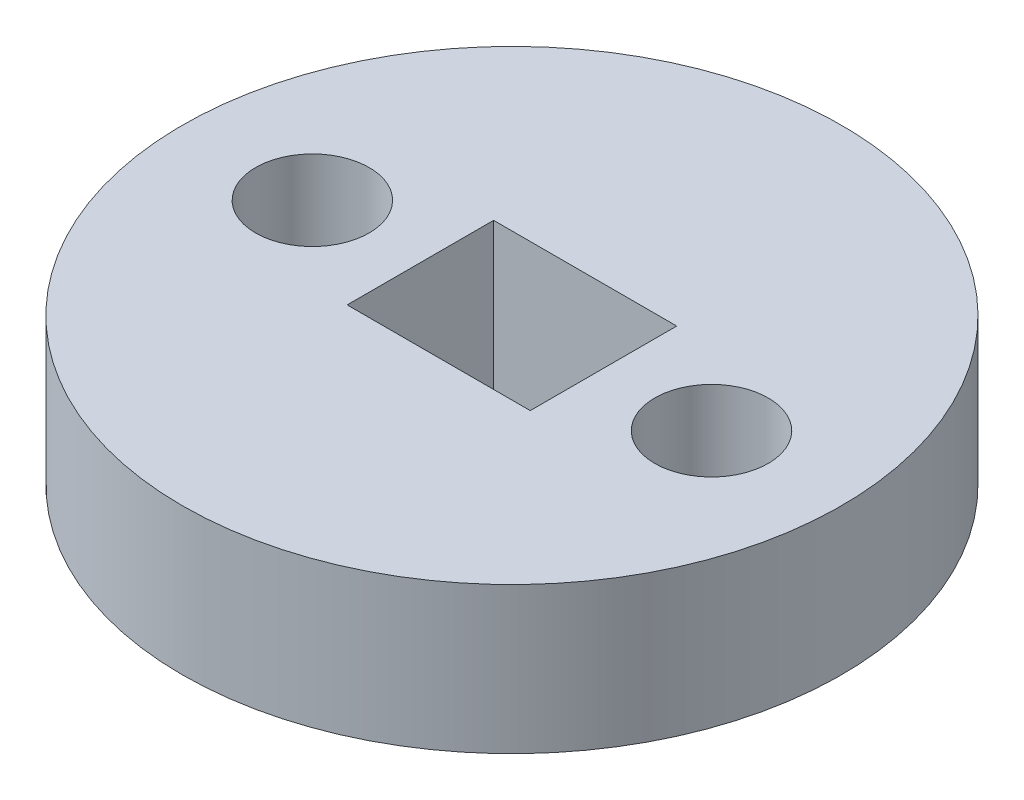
ISO-10303-21;
HEADER;
FILE_DESCRIPTION(('STEP AP214'),'2;1');
FILE_NAME('part.step','',(''),(''),'','','');
FILE_SCHEMA(('AUTOMOTIVE_DESIGN { 1 0 10303 214 1 1 1 1 }'));
ENDSEC;
DATA;
#1=APPLICATION_CONTEXT('core data for automotive mechanical design processes');
#2=APPLICATION_PROTOCOL_DEFINITION('international standard','automotive_design',2000,#1);
#3=PRODUCT_CONTEXT('',#1,'mechanical');
#4=PRODUCT('Part','Part','',(#3));
#5=PRODUCT_RELATED_PRODUCT_CATEGORY('part','',(#4));
#6=PRODUCT_DEFINITION_FORMATION('','',#4);
#7=PRODUCT_DEFINITION_CONTEXT('part definition',#1,'design');
#8=PRODUCT_DEFINITION('design','',#6,#7);
#9=PRODUCT_DEFINITION_SHAPE('','',#8);
#10=(LENGTH_UNIT() NAMED_UNIT(*) SI_UNIT(.MILLI.,.METRE.));
#11=(NAMED_UNIT(*) PLANE_ANGLE_UNIT() SI_UNIT($,.RADIAN.));
#12=(NAMED_UNIT(*) SI_UNIT($,.STERADIAN.) SOLID_ANGLE_UNIT());
#13=UNCERTAINTY_MEASURE_WITH_UNIT(LENGTH_MEASURE(1.E-05),#10,'distance_accuracy_value','');
#14=(GEOMETRIC_REPRESENTATION_CONTEXT(3) GLOBAL_UNCERTAINTY_ASSIGNED_CONTEXT((#13)) GLOBAL_UNIT_ASSIGNED_CONTEXT((#10,
#11,#12)) REPRESENTATION_CONTEXT('',''));
#15=CARTESIAN_POINT('',(0.,0.,0.));
#16=DIRECTION('',(0.,0.,1.));
#17=DIRECTION('',(1.,0.,0.));
#18=AXIS2_PLACEMENT_3D('',#15,#16,#17);
#19=CARTESIAN_POINT('',(0.,-4.,0.));
#20=DIRECTION('',(0.,1.,0.));
#21=DIRECTION('',(0.,0.,1.));
#22=AXIS2_PLACEMENT_3D('',#19,#20,#21);
#23=CYLINDRICAL_SURFACE('',#22,9.);
#24=CARTESIAN_POINT('',(0.,-4.,0.));
#25=DIRECTION('',(0.,1.,0.));
#26=DIRECTION('',(0.,0.,1.));
#27=AXIS2_PLACEMENT_3D('',#24,#25,#26);
#28=CIRCLE('',#27,9.);
#29=CARTESIAN_POINT('',(0.,-4.,9.));
#30=VERTEX_POINT('',#29);
#31=EDGE_CURVE('E11',#30,#30,#28,.T.);
#32=ORIENTED_EDGE('',*,*,#31,.T.);
#33=EDGE_LOOP('',(#32));
#34=FACE_BOUND('',#33,.T.);
#35=CARTESIAN_POINT('',(0.,0.,0.));
#36=DIRECTION('',(0.,1.,0.));
#37=DIRECTION('',(0.,0.,1.));
#38=AXIS2_PLACEMENT_3D('',#35,#36,#37);
#39=CIRCLE('',#38,9.);
#40=CARTESIAN_POINT('',(0.,0.,9.));
#41=VERTEX_POINT('',#40);
#42=EDGE_CURVE('E39',#41,#41,#39,.T.);
#43=ORIENTED_EDGE('',*,*,#42,.F.);
#44=EDGE_LOOP('',(#43));
#45=FACE_BOUND('',#44,.T.);
#46=ADVANCED_FACE('F36',(#34,#45),#23,.T.);
#47=CARTESIAN_POINT('',(0.,-4.,0.));
#48=DIRECTION('',(0.,1.,0.));
#49=DIRECTION('',(0.,0.,1.));
#50=AXIS2_PLACEMENT_3D('',#47,#48,#49);
#51=PLANE('',#50);
#52=DIRECTION('',(-1.,0.,0.));
#53=VECTOR('',#52,1.);
#54=CARTESIAN_POINT('',(0.,-4.,-2.));
#55=LINE('',#54,#53);
#56=CARTESIAN_POINT('',(2.5,-4.,-2.));
#57=VERTEX_POINT('',#56);
#58=CARTESIAN_POINT('',(-2.5,-4.,-2.));
#59=VERTEX_POINT('',#58);
#60=EDGE_CURVE('E107',#57,#59,#55,.T.);
#61=ORIENTED_EDGE('',*,*,#60,.T.);
#62=DIRECTION('',(0.,0.,1.));
#63=VECTOR('',#62,1.);
#64=CARTESIAN_POINT('',(-2.5,-4.,0.));
#65=LINE('',#64,#63);
#66=CARTESIAN_POINT('',(-2.5,-4.,2.));
#67=VERTEX_POINT('',#66);
#68=EDGE_CURVE('E110',#59,#67,#65,.T.);
#69=ORIENTED_EDGE('',*,*,#68,.T.);
#70=DIRECTION('',(1.,0.,0.));
#71=VECTOR('',#70,1.);
#72=CARTESIAN_POINT('',(0.,-4.,2.));
#73=LINE('',#72,#71);
#74=CARTESIAN_POINT('',(2.5,-4.,2.));
#75=VERTEX_POINT('',#74);
#76=EDGE_CURVE('E102',#67,#75,#73,.T.);
#77=ORIENTED_EDGE('',*,*,#76,.T.);
#78=DIRECTION('',(0.,0.,-1.));
#79=VECTOR('',#78,1.);
#80=CARTESIAN_POINT('',(2.5,-4.,0.));
#81=LINE('',#80,#79);
#82=EDGE_CURVE('E82',#75,#57,#81,.T.);
#83=ORIENTED_EDGE('',*,*,#82,.T.);
#84=EDGE_LOOP('',(#61,#69,#77,#83));
#85=FACE_BOUND('',#84,.T.);
#86=CARTESIAN_POINT('',(-5.45,-4.,0.));
#87=DIRECTION('',(0.,1.,0.));
#88=DIRECTION('',(0.,0.,1.));
#89=AXIS2_PLACEMENT_3D('',#86,#87,#88);
#90=CIRCLE('',#89,1.55);
#91=CARTESIAN_POINT('',(-5.45,-4.,1.55));
#92=VERTEX_POINT('',#91);
#93=EDGE_CURVE('E122',#92,#92,#90,.T.);
#94=ORIENTED_EDGE('',*,*,#93,.T.);
#95=EDGE_LOOP('',(#94));
#96=FACE_BOUND('',#95,.T.);
#97=CARTESIAN_POINT('',(5.45,-4.,0.));
#98=DIRECTION('',(0.,1.,0.));
#99=DIRECTION('',(0.,0.,1.));
#100=AXIS2_PLACEMENT_3D('',#97,#98,#99);
#101=CIRCLE('',#100,1.55);
#102=CARTESIAN_POINT('',(5.45,-4.,1.55));
#103=VERTEX_POINT('',#102);
#104=EDGE_CURVE('E117',#103,#103,#101,.T.);
#105=ORIENTED_EDGE('',*,*,#104,.T.);
#106=EDGE_LOOP('',(#105));
#107=FACE_BOUND('',#106,.T.);
#108=ORIENTED_EDGE('',*,*,#31,.F.);
#109=EDGE_LOOP('',(#108));
#110=FACE_BOUND('',#109,.T.);
#111=ADVANCED_FACE('F131',(#85,#96,#107,#110),#51,.F.);
#112=CARTESIAN_POINT('',(0.,0.,0.));
#113=DIRECTION('',(0.,1.,0.));
#114=DIRECTION('',(0.,0.,1.));
#115=AXIS2_PLACEMENT_3D('',#112,#113,#114);
#116=PLANE('',#115);
#117=DIRECTION('',(0.,0.,1.));
#118=VECTOR('',#117,1.);
#119=CARTESIAN_POINT('',(-2.5,0.,2.));
#120=LINE('',#119,#118);
#121=CARTESIAN_POINT('',(-2.5,0.,-2.));
#122=VERTEX_POINT('',#121);
#123=CARTESIAN_POINT('',(-2.5,0.,2.));
#124=VERTEX_POINT('',#123);
#125=EDGE_CURVE('E58',#122,#124,#120,.T.);
#126=ORIENTED_EDGE('',*,*,#125,.F.);
#127=DIRECTION('',(-1.,0.,0.));
#128=VECTOR('',#127,1.);
#129=CARTESIAN_POINT('',(-2.5,0.,-2.));
#130=LINE('',#129,#128);
#131=CARTESIAN_POINT('',(2.5,0.,-2.));
#132=VERTEX_POINT('',#131);
#133=EDGE_CURVE('E95',#132,#122,#130,.T.);
#134=ORIENTED_EDGE('',*,*,#133,.F.);
#135=DIRECTION('',(0.,0.,-1.));
#136=VECTOR('',#135,1.);
#137=CARTESIAN_POINT('',(2.5,0.,2.));
#138=LINE('',#137,#136);
#139=CARTESIAN_POINT('',(2.5,0.,2.));
#140=VERTEX_POINT('',#139);
#141=EDGE_CURVE('E79',#140,#132,#138,.T.);
#142=ORIENTED_EDGE('',*,*,#141,.F.);
#143=DIRECTION('',(1.,0.,0.));
#144=VECTOR('',#143,1.);
#145=CARTESIAN_POINT('',(-2.5,0.,2.));
#146=LINE('',#145,#144);
#147=EDGE_CURVE('E88',#124,#140,#146,.T.);
#148=ORIENTED_EDGE('',*,*,#147,.F.);
#149=EDGE_LOOP('',(#126,#134,#142,#148));
#150=FACE_BOUND('',#149,.T.);
#151=CARTESIAN_POINT('',(-5.45,0.,0.));
#152=DIRECTION('',(0.,1.,0.));
#153=DIRECTION('',(0.,0.,1.));
#154=AXIS2_PLACEMENT_3D('',#151,#152,#153);
#155=CIRCLE('',#154,1.55);
#156=CARTESIAN_POINT('',(-5.45,0.,1.55));
#157=VERTEX_POINT('',#156);
#158=EDGE_CURVE('E114',#157,#157,#155,.T.);
#159=ORIENTED_EDGE('',*,*,#158,.F.);
#160=EDGE_LOOP('',(#159));
#161=FACE_BOUND('',#160,.T.);
#162=CARTESIAN_POINT('',(5.45,0.,0.));
#163=DIRECTION('',(0.,1.,0.));
#164=DIRECTION('',(0.,0.,1.));
#165=AXIS2_PLACEMENT_3D('',#162,#163,#164);
#166=CIRCLE('',#165,1.55);
#167=CARTESIAN_POINT('',(5.45,0.,1.55));
#168=VERTEX_POINT('',#167);
#169=EDGE_CURVE('E113',#168,#168,#166,.T.);
#170=ORIENTED_EDGE('',*,*,#169,.F.);
#171=EDGE_LOOP('',(#170));
#172=FACE_BOUND('',#171,.T.);
#173=ORIENTED_EDGE('',*,*,#42,.T.);
#174=EDGE_LOOP('',(#173));
#175=FACE_BOUND('',#174,.T.);
#176=ADVANCED_FACE('F92',(#150,#161,#172,#175),#116,.T.);
#177=CARTESIAN_POINT('',(5.45,-10.,0.));
#178=DIRECTION('',(0.,1.,0.));
#179=DIRECTION('',(0.,0.,1.));
#180=AXIS2_PLACEMENT_3D('',#177,#178,#179);
#181=CYLINDRICAL_SURFACE('',#180,1.55);
#182=ORIENTED_EDGE('',*,*,#169,.T.);
#183=EDGE_LOOP('',(#182));
#184=FACE_BOUND('',#183,.T.);
#185=ORIENTED_EDGE('',*,*,#104,.F.);
#186=EDGE_LOOP('',(#185));
#187=FACE_BOUND('',#186,.T.);
#188=ADVANCED_FACE('F143',(#184,#187),#181,.F.);
#189=CARTESIAN_POINT('',(-5.45,-10.,0.));
#190=DIRECTION('',(0.,1.,0.));
#191=DIRECTION('',(0.,0.,1.));
#192=AXIS2_PLACEMENT_3D('',#189,#190,#191);
#193=CYLINDRICAL_SURFACE('',#192,1.55);
#194=ORIENTED_EDGE('',*,*,#158,.T.);
#195=EDGE_LOOP('',(#194));
#196=FACE_BOUND('',#195,.T.);
#197=ORIENTED_EDGE('',*,*,#93,.F.);
#198=EDGE_LOOP('',(#197));
#199=FACE_BOUND('',#198,.T.);
#200=ADVANCED_FACE('F147',(#196,#199),#193,.F.);
#201=CARTESIAN_POINT('',(-2.5,-10.,2.));
#202=DIRECTION('',(-1.,0.,0.));
#203=DIRECTION('',(0.,0.,1.));
#204=AXIS2_PLACEMENT_3D('',#201,#202,#203);
#205=PLANE('',#204);
#206=DIRECTION('',(0.,1.,0.));
#207=VECTOR('',#206,1.);
#208=CARTESIAN_POINT('',(-2.5,-10.,-2.));
#209=LINE('',#208,#207);
#210=EDGE_CURVE('E100',#59,#122,#209,.T.);
#211=ORIENTED_EDGE('',*,*,#210,.T.);
#212=ORIENTED_EDGE('',*,*,#125,.T.);
#213=DIRECTION('',(0.,1.,0.));
#214=VECTOR('',#213,1.);
#215=CARTESIAN_POINT('',(-2.5,-10.,2.));
#216=LINE('',#215,#214);
#217=EDGE_CURVE('E85',#67,#124,#216,.T.);
#218=ORIENTED_EDGE('',*,*,#217,.F.);
#219=ORIENTED_EDGE('',*,*,#68,.F.);
#220=EDGE_LOOP('',(#211,#212,#218,#219));
#221=FACE_BOUND('',#220,.T.);
#222=ADVANCED_FACE('F151',(#221),#205,.F.);
#223=CARTESIAN_POINT('',(-2.5,-10.,-2.));
#224=DIRECTION('',(0.,0.,-1.));
#225=DIRECTION('',(-1.,0.,0.));
#226=AXIS2_PLACEMENT_3D('',#223,#224,#225);
#227=PLANE('',#226);
#228=DIRECTION('',(0.,1.,0.));
#229=VECTOR('',#228,1.);
#230=CARTESIAN_POINT('',(2.5,-10.,-2.));
#231=LINE('',#230,#229);
#232=EDGE_CURVE('E84',#57,#132,#231,.T.);
#233=ORIENTED_EDGE('',*,*,#232,.T.);
#234=ORIENTED_EDGE('',*,*,#133,.T.);
#235=ORIENTED_EDGE('',*,*,#210,.F.);
#236=ORIENTED_EDGE('',*,*,#60,.F.);
#237=EDGE_LOOP('',(#233,#234,#235,#236));
#238=FACE_BOUND('',#237,.T.);
#239=ADVANCED_FACE('F155',(#238),#227,.F.);
#240=CARTESIAN_POINT('',(2.5,-10.,2.));
#241=DIRECTION('',(1.,0.,0.));
#242=DIRECTION('',(0.,0.,-1.));
#243=AXIS2_PLACEMENT_3D('',#240,#241,#242);
#244=PLANE('',#243);
#245=DIRECTION('',(0.,1.,0.));
#246=VECTOR('',#245,1.);
#247=CARTESIAN_POINT('',(2.5,-10.,2.));
#248=LINE('',#247,#246);
#249=EDGE_CURVE('E50',#75,#140,#248,.T.);
#250=ORIENTED_EDGE('',*,*,#249,.T.);
#251=ORIENTED_EDGE('',*,*,#141,.T.);
#252=ORIENTED_EDGE('',*,*,#232,.F.);
#253=ORIENTED_EDGE('',*,*,#82,.F.);
#254=EDGE_LOOP('',(#250,#251,#252,#253));
#255=FACE_BOUND('',#254,.T.);
#256=ADVANCED_FACE('F76',(#255),#244,.F.);
#257=CARTESIAN_POINT('',(-2.5,-10.,2.));
#258=DIRECTION('',(0.,0.,1.));
#259=DIRECTION('',(1.,0.,0.));
#260=AXIS2_PLACEMENT_3D('',#257,#258,#259);
#261=PLANE('',#260);
#262=ORIENTED_EDGE('',*,*,#217,.T.);
#263=ORIENTED_EDGE('',*,*,#147,.T.);
#264=ORIENTED_EDGE('',*,*,#249,.F.);
#265=ORIENTED_EDGE('',*,*,#76,.F.);
#266=EDGE_LOOP('',(#262,#263,#264,#265));
#267=FACE_BOUND('',#266,.T.);
#268=ADVANCED_FACE('F89',(#267),#261,.F.);
#269=CLOSED_SHELL('',(#46,#111,#176,#188,#200,#222,#239,#256,#268));
#270=MANIFOLD_SOLID_BREP('B2',#269);
#271=ADVANCED_BREP_SHAPE_REPRESENTATION('',(#18,#270),#14);
#272=SHAPE_DEFINITION_REPRESENTATION(#9,#271);
ENDSEC;
END-ISO-10303-21;
